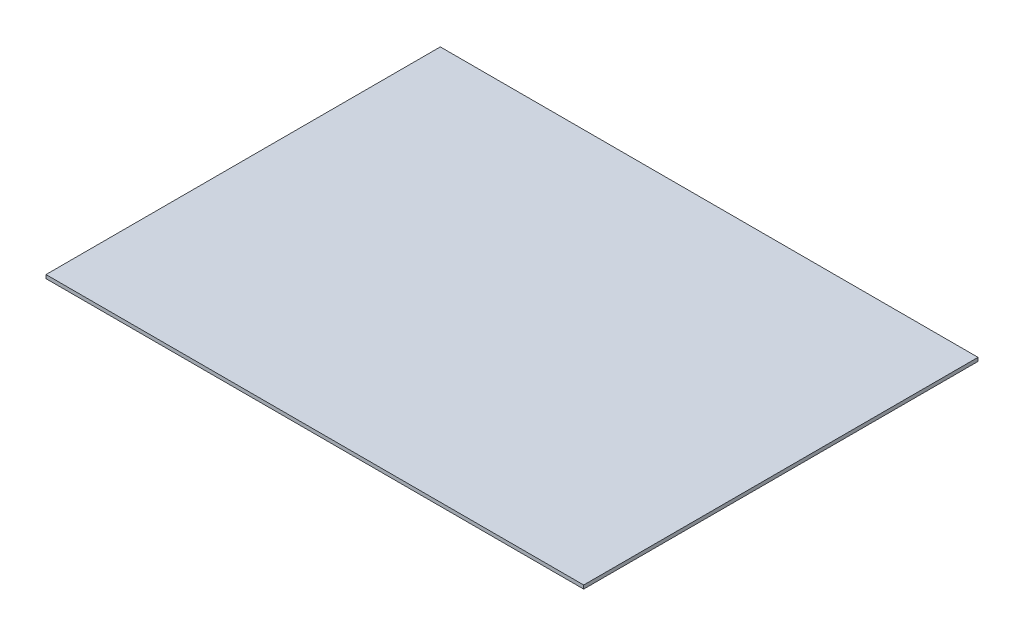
ISO-10303-21;
HEADER;
FILE_DESCRIPTION(('STEP AP214'),'2;1');
FILE_NAME('part.step','',(''),(''),'','','');
FILE_SCHEMA(('AUTOMOTIVE_DESIGN { 1 0 10303 214 1 1 1 1 }'));
ENDSEC;
DATA;
#1=APPLICATION_CONTEXT('core data for automotive mechanical design processes');
#2=APPLICATION_PROTOCOL_DEFINITION('international standard','automotive_design',2000,#1);
#3=PRODUCT_CONTEXT('',#1,'mechanical');
#4=PRODUCT('Part','Part','',(#3));
#5=PRODUCT_RELATED_PRODUCT_CATEGORY('part','',(#4));
#6=PRODUCT_DEFINITION_FORMATION('','',#4);
#7=PRODUCT_DEFINITION_CONTEXT('part definition',#1,'design');
#8=PRODUCT_DEFINITION('design','',#6,#7);
#9=PRODUCT_DEFINITION_SHAPE('','',#8);
#10=(LENGTH_UNIT() NAMED_UNIT(*) SI_UNIT(.MILLI.,.METRE.));
#11=(NAMED_UNIT(*) PLANE_ANGLE_UNIT() SI_UNIT($,.RADIAN.));
#12=(NAMED_UNIT(*) SI_UNIT($,.STERADIAN.) SOLID_ANGLE_UNIT());
#13=UNCERTAINTY_MEASURE_WITH_UNIT(LENGTH_MEASURE(1.E-05),#10,'distance_accuracy_value','');
#14=(GEOMETRIC_REPRESENTATION_CONTEXT(3) GLOBAL_UNCERTAINTY_ASSIGNED_CONTEXT((#13)) GLOBAL_UNIT_ASSIGNED_CONTEXT((#10,
#11,#12)) REPRESENTATION_CONTEXT('',''));
#15=CARTESIAN_POINT('',(0.,0.,0.));
#16=DIRECTION('',(0.,0.,1.));
#17=DIRECTION('',(1.,0.,0.));
#18=AXIS2_PLACEMENT_3D('',#15,#16,#17);
#19=CARTESIAN_POINT('',(0.,0.762,0.));
#20=DIRECTION('',(1.,0.,0.));
#21=DIRECTION('',(0.,0.,-1.));
#22=AXIS2_PLACEMENT_3D('',#19,#20,#21);
#23=PLANE('',#22);
#24=DIRECTION('',(0.,0.,1.));
#25=VECTOR('',#24,1.);
#26=CARTESIAN_POINT('',(0.,0.,0.));
#27=LINE('',#26,#25);
#28=CARTESIAN_POINT('',(0.,0.,-83.82));
#29=VERTEX_POINT('',#28);
#30=CARTESIAN_POINT('',(0.,0.,0.));
#31=VERTEX_POINT('',#30);
#32=EDGE_CURVE('E97',#29,#31,#27,.T.);
#33=ORIENTED_EDGE('',*,*,#32,.T.);
#34=DIRECTION('',(0.,-1.,0.));
#35=VECTOR('',#34,1.);
#36=CARTESIAN_POINT('',(0.,0.762,0.));
#37=LINE('',#36,#35);
#38=CARTESIAN_POINT('',(0.,0.762,0.));
#39=VERTEX_POINT('',#38);
#40=EDGE_CURVE('E12',#39,#31,#37,.T.);
#41=ORIENTED_EDGE('',*,*,#40,.F.);
#42=DIRECTION('',(0.,0.,1.));
#43=VECTOR('',#42,1.);
#44=CARTESIAN_POINT('',(0.,0.762,0.));
#45=LINE('',#44,#43);
#46=CARTESIAN_POINT('',(0.,0.762,-83.82));
#47=VERTEX_POINT('',#46);
#48=EDGE_CURVE('E85',#47,#39,#45,.T.);
#49=ORIENTED_EDGE('',*,*,#48,.F.);
#50=DIRECTION('',(0.,-1.,0.));
#51=VECTOR('',#50,1.);
#52=CARTESIAN_POINT('',(0.,0.762,-83.82));
#53=LINE('',#52,#51);
#54=EDGE_CURVE('E93',#47,#29,#53,.T.);
#55=ORIENTED_EDGE('',*,*,#54,.T.);
#56=EDGE_LOOP('',(#33,#41,#49,#55));
#57=FACE_BOUND('',#56,.T.);
#58=ADVANCED_FACE('F34',(#57),#23,.F.);
#59=CARTESIAN_POINT('',(0.,0.762,0.));
#60=DIRECTION('',(0.,0.,-1.));
#61=DIRECTION('',(-1.,0.,0.));
#62=AXIS2_PLACEMENT_3D('',#59,#60,#61);
#63=PLANE('',#62);
#64=DIRECTION('',(1.,0.,0.));
#65=VECTOR('',#64,1.);
#66=CARTESIAN_POINT('',(0.,0.,0.));
#67=LINE('',#66,#65);
#68=CARTESIAN_POINT('',(114.3,0.,0.));
#69=VERTEX_POINT('',#68);
#70=EDGE_CURVE('E89',#31,#69,#67,.T.);
#71=ORIENTED_EDGE('',*,*,#70,.T.);
#72=DIRECTION('',(0.,-1.,0.));
#73=VECTOR('',#72,1.);
#74=CARTESIAN_POINT('',(114.3,0.762,0.));
#75=LINE('',#74,#73);
#76=CARTESIAN_POINT('',(114.3,0.762,0.));
#77=VERTEX_POINT('',#76);
#78=EDGE_CURVE('E42',#77,#69,#75,.T.);
#79=ORIENTED_EDGE('',*,*,#78,.F.);
#80=DIRECTION('',(1.,0.,0.));
#81=VECTOR('',#80,1.);
#82=CARTESIAN_POINT('',(0.,0.762,0.));
#83=LINE('',#82,#81);
#84=EDGE_CURVE('E80',#39,#77,#83,.T.);
#85=ORIENTED_EDGE('',*,*,#84,.F.);
#86=ORIENTED_EDGE('',*,*,#40,.T.);
#87=EDGE_LOOP('',(#71,#79,#85,#86));
#88=FACE_BOUND('',#87,.T.);
#89=ADVANCED_FACE('F88',(#88),#63,.F.);
#90=CARTESIAN_POINT('',(114.3,0.762,0.));
#91=DIRECTION('',(-1.,0.,0.));
#92=DIRECTION('',(0.,0.,1.));
#93=AXIS2_PLACEMENT_3D('',#90,#91,#92);
#94=PLANE('',#93);
#95=DIRECTION('',(0.,0.,-1.));
#96=VECTOR('',#95,1.);
#97=CARTESIAN_POINT('',(114.3,0.,0.));
#98=LINE('',#97,#96);
#99=CARTESIAN_POINT('',(114.3,0.,-83.82));
#100=VERTEX_POINT('',#99);
#101=EDGE_CURVE('E67',#69,#100,#98,.T.);
#102=ORIENTED_EDGE('',*,*,#101,.T.);
#103=DIRECTION('',(0.,-1.,0.));
#104=VECTOR('',#103,1.);
#105=CARTESIAN_POINT('',(114.3,0.762,-83.82));
#106=LINE('',#105,#104);
#107=CARTESIAN_POINT('',(114.3,0.762,-83.82));
#108=VERTEX_POINT('',#107);
#109=EDGE_CURVE('E90',#108,#100,#106,.T.);
#110=ORIENTED_EDGE('',*,*,#109,.F.);
#111=DIRECTION('',(0.,0.,-1.));
#112=VECTOR('',#111,1.);
#113=CARTESIAN_POINT('',(114.3,0.762,0.));
#114=LINE('',#113,#112);
#115=EDGE_CURVE('E83',#77,#108,#114,.T.);
#116=ORIENTED_EDGE('',*,*,#115,.F.);
#117=ORIENTED_EDGE('',*,*,#78,.T.);
#118=EDGE_LOOP('',(#102,#110,#116,#117));
#119=FACE_BOUND('',#118,.T.);
#120=ADVANCED_FACE('F91',(#119),#94,.F.);
#121=CARTESIAN_POINT('',(0.,0.762,-83.82));
#122=DIRECTION('',(0.,0.,1.));
#123=DIRECTION('',(1.,0.,0.));
#124=AXIS2_PLACEMENT_3D('',#121,#122,#123);
#125=PLANE('',#124);
#126=DIRECTION('',(-1.,0.,0.));
#127=VECTOR('',#126,1.);
#128=CARTESIAN_POINT('',(0.,0.,-83.82));
#129=LINE('',#128,#127);
#130=EDGE_CURVE('E73',#100,#29,#129,.T.);
#131=ORIENTED_EDGE('',*,*,#130,.T.);
#132=ORIENTED_EDGE('',*,*,#54,.F.);
#133=DIRECTION('',(-1.,0.,0.));
#134=VECTOR('',#133,1.);
#135=CARTESIAN_POINT('',(0.,0.762,-83.82));
#136=LINE('',#135,#134);
#137=EDGE_CURVE('E50',#108,#47,#136,.T.);
#138=ORIENTED_EDGE('',*,*,#137,.F.);
#139=ORIENTED_EDGE('',*,*,#109,.T.);
#140=EDGE_LOOP('',(#131,#132,#138,#139));
#141=FACE_BOUND('',#140,.T.);
#142=ADVANCED_FACE('F104',(#141),#125,.F.);
#143=CARTESIAN_POINT('',(0.,0.762,0.));
#144=DIRECTION('',(0.,-1.,0.));
#145=DIRECTION('',(0.,0.,-1.));
#146=AXIS2_PLACEMENT_3D('',#143,#144,#145);
#147=PLANE('',#146);
#148=ORIENTED_EDGE('',*,*,#48,.T.);
#149=ORIENTED_EDGE('',*,*,#84,.T.);
#150=ORIENTED_EDGE('',*,*,#115,.T.);
#151=ORIENTED_EDGE('',*,*,#137,.T.);
#152=EDGE_LOOP('',(#148,#149,#150,#151));
#153=FACE_BOUND('',#152,.T.);
#154=ADVANCED_FACE('F81',(#153),#147,.F.);
#155=CARTESIAN_POINT('',(0.,0.,0.));
#156=DIRECTION('',(0.,-1.,0.));
#157=DIRECTION('',(0.,0.,-1.));
#158=AXIS2_PLACEMENT_3D('',#155,#156,#157);
#159=PLANE('',#158);
#160=ORIENTED_EDGE('',*,*,#32,.F.);
#161=ORIENTED_EDGE('',*,*,#130,.F.);
#162=ORIENTED_EDGE('',*,*,#101,.F.);
#163=ORIENTED_EDGE('',*,*,#70,.F.);
#164=EDGE_LOOP('',(#160,#161,#162,#163));
#165=FACE_BOUND('',#164,.T.);
#166=ADVANCED_FACE('F107',(#165),#159,.T.);
#167=CLOSED_SHELL('',(#58,#89,#120,#142,#154,#166));
#168=MANIFOLD_SOLID_BREP('B2',#167);
#169=ADVANCED_BREP_SHAPE_REPRESENTATION('',(#18,#168),#14);
#170=SHAPE_DEFINITION_REPRESENTATION(#9,#169);
ENDSEC;
END-ISO-10303-21;
